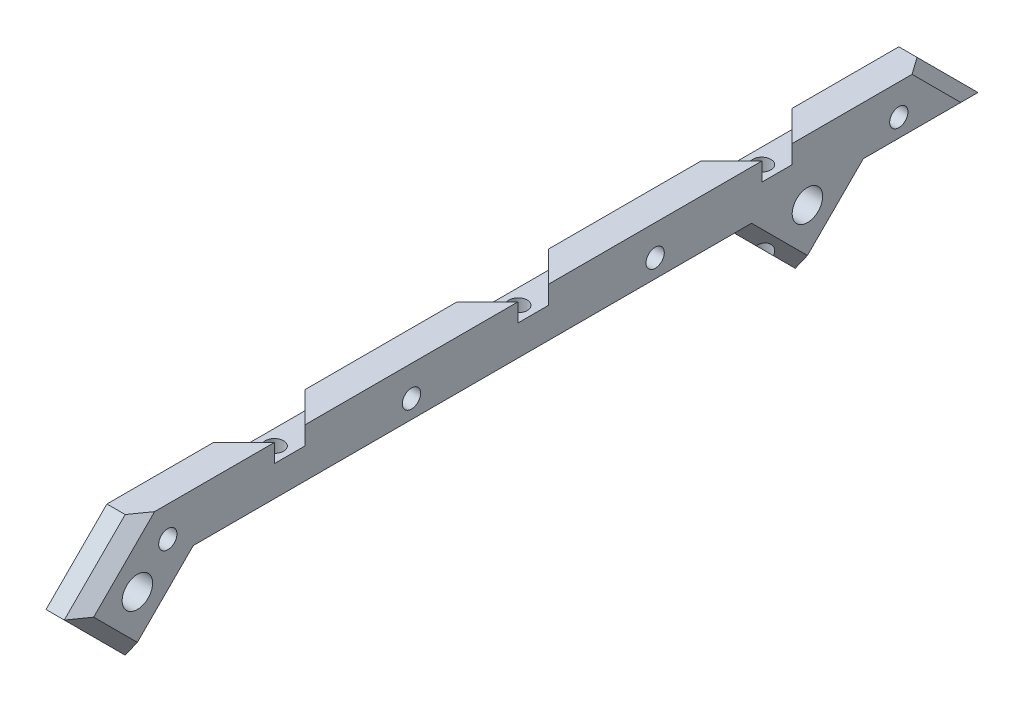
ISO-10303-21;
HEADER;
FILE_DESCRIPTION(('STEP AP214'),'2;1');
FILE_NAME('part.step','',(''),(''),'','','');
FILE_SCHEMA(('AUTOMOTIVE_DESIGN { 1 0 10303 214 1 1 1 1 }'));
ENDSEC;
DATA;
#1=APPLICATION_CONTEXT('core data for automotive mechanical design processes');
#2=APPLICATION_PROTOCOL_DEFINITION('international standard','automotive_design',2000,#1);
#3=PRODUCT_CONTEXT('',#1,'mechanical');
#4=PRODUCT('Part','Part','',(#3));
#5=PRODUCT_RELATED_PRODUCT_CATEGORY('part','',(#4));
#6=PRODUCT_DEFINITION_FORMATION('','',#4);
#7=PRODUCT_DEFINITION_CONTEXT('part definition',#1,'design');
#8=PRODUCT_DEFINITION('design','',#6,#7);
#9=PRODUCT_DEFINITION_SHAPE('','',#8);
#10=(LENGTH_UNIT() NAMED_UNIT(*) SI_UNIT(.MILLI.,.METRE.));
#11=(NAMED_UNIT(*) PLANE_ANGLE_UNIT() SI_UNIT($,.RADIAN.));
#12=(NAMED_UNIT(*) SI_UNIT($,.STERADIAN.) SOLID_ANGLE_UNIT());
#13=UNCERTAINTY_MEASURE_WITH_UNIT(LENGTH_MEASURE(1.E-05),#10,'distance_accuracy_value','');
#14=(GEOMETRIC_REPRESENTATION_CONTEXT(3) GLOBAL_UNCERTAINTY_ASSIGNED_CONTEXT((#13)) GLOBAL_UNIT_ASSIGNED_CONTEXT((#10,
#11,#12)) REPRESENTATION_CONTEXT('',''));
#15=CARTESIAN_POINT('',(0.,0.,0.));
#16=DIRECTION('',(0.,0.,1.));
#17=DIRECTION('',(1.,0.,0.));
#18=AXIS2_PLACEMENT_3D('',#15,#16,#17);
#19=CARTESIAN_POINT('',(5.,9.99999999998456,8.84041771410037E-13));
#20=DIRECTION('',(0.,1.,0.));
#21=DIRECTION('',(0.,0.,1.));
#22=AXIS2_PLACEMENT_3D('',#19,#20,#21);
#23=PLANE('',#22);
#24=DIRECTION('',(-0.707106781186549,0.,-0.707106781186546));
#25=VECTOR('',#24,1.);
#26=CARTESIAN_POINT('',(5.,9.99999999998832,-42.4999999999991));
#27=LINE('',#26,#25);
#28=CARTESIAN_POINT('',(5.,9.99999999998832,-42.4999999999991));
#29=VERTEX_POINT('',#28);
#30=CARTESIAN_POINT('',(0.,9.99999999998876,-47.4999999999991));
#31=VERTEX_POINT('',#30);
#32=EDGE_CURVE('E429',#29,#31,#27,.T.);
#33=ORIENTED_EDGE('',*,*,#32,.F.);
#34=DIRECTION('',(0.,0.,-1.));
#35=VECTOR('',#34,1.);
#36=CARTESIAN_POINT('',(5.,9.99999999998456,8.84041771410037E-13));
#37=LINE('',#36,#35);
#38=CARTESIAN_POINT('',(5.,9.99999999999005,-62.1715728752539));
#39=VERTEX_POINT('',#38);
#40=EDGE_CURVE('E428',#29,#39,#37,.T.);
#41=ORIENTED_EDGE('',*,*,#40,.T.);
#42=DIRECTION('',(-0.577350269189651,0.,-0.816496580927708));
#43=VECTOR('',#42,1.);
#44=CARTESIAN_POINT('',(34.3079605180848,9.99999999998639,-20.7238576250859));
#45=LINE('',#44,#43);
#46=CARTESIAN_POINT('',(2.99999999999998,9.9999999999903,-64.9999999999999));
#47=VERTEX_POINT('',#46);
#48=EDGE_CURVE('E371',#39,#47,#45,.T.);
#49=ORIENTED_EDGE('',*,*,#48,.T.);
#50=DIRECTION('',(-1.,0.,0.));
#51=VECTOR('',#50,1.);
#52=CARTESIAN_POINT('',(5.,9.9999999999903,-64.9999999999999));
#53=LINE('',#52,#51);
#54=CARTESIAN_POINT('',(0.,9.9999999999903,-64.9999999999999));
#55=VERTEX_POINT('',#54);
#56=EDGE_CURVE('E337',#47,#55,#53,.T.);
#57=ORIENTED_EDGE('',*,*,#56,.T.);
#58=DIRECTION('',(0.,0.,-1.));
#59=VECTOR('',#58,1.);
#60=CARTESIAN_POINT('',(0.,9.99999999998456,8.84041771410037E-13));
#61=LINE('',#60,#59);
#62=EDGE_CURVE('E324',#31,#55,#61,.T.);
#63=ORIENTED_EDGE('',*,*,#62,.F.);
#64=EDGE_LOOP('',(#33,#41,#49,#57,#63));
#65=FACE_BOUND('',#64,.T.);
#66=ADVANCED_FACE('F40',(#65),#23,.T.);
#67=DIRECTION('',(0.707106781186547,0.,-0.707106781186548));
#68=VECTOR('',#67,1.);
#69=CARTESIAN_POINT('',(23.75,9.99999999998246,23.7500000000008));
#70=LINE('',#69,#68);
#71=CARTESIAN_POINT('',(0.,9.99999999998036,47.5000000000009));
#72=VERTEX_POINT('',#71);
#73=CARTESIAN_POINT('',(5.,9.9999999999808,42.5000000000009));
#74=VERTEX_POINT('',#73);
#75=EDGE_CURVE('E986',#72,#74,#70,.T.);
#76=ORIENTED_EDGE('',*,*,#75,.F.);
#77=CARTESIAN_POINT('',(0.,9.99999999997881,64.9999999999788));
#78=VERTEX_POINT('',#77);
#79=EDGE_CURVE('E325',#78,#72,#61,.T.);
#80=ORIENTED_EDGE('',*,*,#79,.F.);
#81=DIRECTION('',(-1.,0.,0.));
#82=VECTOR('',#81,1.);
#83=CARTESIAN_POINT('',(5.,9.99999999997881,64.9999999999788));
#84=LINE('',#83,#82);
#85=CARTESIAN_POINT('',(2.99999999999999,9.99999999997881,64.9999999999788));
#86=VERTEX_POINT('',#85);
#87=EDGE_CURVE('E335',#86,#78,#84,.T.);
#88=ORIENTED_EDGE('',*,*,#87,.F.);
#89=DIRECTION('',(-0.577350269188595,0.,0.816496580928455));
#90=VECTOR('',#89,1.);
#91=CARTESIAN_POINT('',(34.3079605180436,9.99999999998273,20.7238576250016));
#92=LINE('',#91,#90);
#93=CARTESIAN_POINT('',(5.,9.99999999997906,62.171572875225));
#94=VERTEX_POINT('',#93);
#95=EDGE_CURVE('E369',#86,#94,#92,.F.);
#96=ORIENTED_EDGE('',*,*,#95,.T.);
#97=EDGE_CURVE('E301',#94,#74,#37,.T.);
#98=ORIENTED_EDGE('',*,*,#97,.T.);
#99=EDGE_LOOP('',(#76,#80,#88,#96,#98));
#100=FACE_BOUND('',#99,.T.);
#101=ADVANCED_FACE('F524',(#100),#23,.T.);
#102=DIRECTION('',(-0.707106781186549,0.,-0.707106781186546));
#103=VECTOR('',#102,1.);
#104=CARTESIAN_POINT('',(-16.25,9.99999999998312,16.2500000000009));
#105=LINE('',#104,#103);
#106=CARTESIAN_POINT('',(5.,9.99999999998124,37.5000000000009));
#107=VERTEX_POINT('',#106);
#108=CARTESIAN_POINT('',(0.,9.99999999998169,32.5000000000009));
#109=VERTEX_POINT('',#108);
#110=EDGE_CURVE('E448',#107,#109,#105,.T.);
#111=ORIENTED_EDGE('',*,*,#110,.F.);
#112=CARTESIAN_POINT('',(5.,9.99999999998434,2.50000000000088));
#113=VERTEX_POINT('',#112);
#114=EDGE_CURVE('E433',#107,#113,#37,.T.);
#115=ORIENTED_EDGE('',*,*,#114,.T.);
#116=DIRECTION('',(0.707106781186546,0.,-0.707106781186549));
#117=VECTOR('',#116,1.);
#118=CARTESIAN_POINT('',(3.75000000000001,9.99999999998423,3.75000000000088));
#119=LINE('',#118,#117);
#120=CARTESIAN_POINT('',(0.,9.9999999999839,7.5000000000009));
#121=VERTEX_POINT('',#120);
#122=EDGE_CURVE('E446',#121,#113,#119,.T.);
#123=ORIENTED_EDGE('',*,*,#122,.F.);
#124=EDGE_CURVE('E329',#109,#121,#61,.T.);
#125=ORIENTED_EDGE('',*,*,#124,.F.);
#126=EDGE_LOOP('',(#111,#115,#123,#125));
#127=FACE_BOUND('',#126,.T.);
#128=ADVANCED_FACE('F444',(#127),#23,.T.);
#129=CARTESIAN_POINT('',(5.,-37.5000000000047,37.4999999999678));
#130=DIRECTION('',(0.,0.707106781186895,-0.7071067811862));
#131=DIRECTION('',(0.,0.7071067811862,0.707106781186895));
#132=AXIS2_PLACEMENT_3D('',#129,#130,#131);
#133=PLANE('',#132);
#134=DIRECTION('',(-1.,0.,0.));
#135=VECTOR('',#134,1.);
#136=CARTESIAN_POINT('',(5.,-10.,64.9999999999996));
#137=LINE('',#136,#135);
#138=CARTESIAN_POINT('',(2.99999999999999,-10.,64.9999999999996));
#139=VERTEX_POINT('',#138);
#140=CARTESIAN_POINT('',(0.,-10.,64.9999999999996));
#141=VERTEX_POINT('',#140);
#142=EDGE_CURVE('E350',#139,#141,#137,.T.);
#143=ORIENTED_EDGE('',*,*,#142,.F.);
#144=DIRECTION('',(0.,0.7071067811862,0.707106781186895));
#145=VECTOR('',#144,1.);
#146=CARTESIAN_POINT('',(2.99999999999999,0.,75.0000000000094));
#147=LINE('',#146,#145);
#148=CARTESIAN_POINT('',(2.99999999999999,0.,75.0000000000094));
#149=VERTEX_POINT('',#148);
#150=EDGE_CURVE('E50',#139,#149,#147,.T.);
#151=ORIENTED_EDGE('',*,*,#150,.T.);
#152=DIRECTION('',(-1.,0.,0.));
#153=VECTOR('',#152,1.);
#154=CARTESIAN_POINT('',(5.,0.,75.0000000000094));
#155=LINE('',#154,#153);
#156=CARTESIAN_POINT('',(0.,0.,75.0000000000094));
#157=VERTEX_POINT('',#156);
#158=EDGE_CURVE('E333',#149,#157,#155,.T.);
#159=ORIENTED_EDGE('',*,*,#158,.T.);
#160=DIRECTION('',(0.,-0.7071067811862,-0.707106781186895));
#161=VECTOR('',#160,1.);
#162=CARTESIAN_POINT('',(0.,-37.5000000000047,37.4999999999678));
#163=LINE('',#162,#161);
#164=EDGE_CURVE('E298',#157,#141,#163,.T.);
#165=ORIENTED_EDGE('',*,*,#164,.T.);
#166=EDGE_LOOP('',(#143,#151,#159,#165));
#167=FACE_BOUND('',#166,.T.);
#168=ADVANCED_FACE('F537',(#167),#133,.F.);
#169=CARTESIAN_POINT('',(5.,27.4999999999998,27.5000000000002));
#170=DIRECTION('',(0.,0.707106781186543,0.707106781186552));
#171=DIRECTION('',(0.,-0.707106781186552,0.707106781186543));
#172=AXIS2_PLACEMENT_3D('',#169,#170,#171);
#173=PLANE('',#172);
#174=DIRECTION('',(-1.,0.,0.));
#175=VECTOR('',#174,1.);
#176=CARTESIAN_POINT('',(5.,0.,54.9999999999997));
#177=LINE('',#176,#175);
#178=CARTESIAN_POINT('',(2.99999999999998,0.,54.9999999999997));
#179=VERTEX_POINT('',#178);
#180=CARTESIAN_POINT('',(0.,0.,54.9999999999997));
#181=VERTEX_POINT('',#180);
#182=EDGE_CURVE('E348',#179,#181,#177,.T.);
#183=ORIENTED_EDGE('',*,*,#182,.F.);
#184=DIRECTION('',(0.,-0.707106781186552,0.707106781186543));
#185=VECTOR('',#184,1.);
#186=CARTESIAN_POINT('',(2.99999999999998,-10.,64.9999999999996));
#187=LINE('',#186,#185);
#188=EDGE_CURVE('E263',#179,#139,#187,.T.);
#189=ORIENTED_EDGE('',*,*,#188,.T.);
#190=ORIENTED_EDGE('',*,*,#142,.T.);
#191=DIRECTION('',(0.,0.707106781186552,-0.707106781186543));
#192=VECTOR('',#191,1.);
#193=CARTESIAN_POINT('',(0.,27.4999999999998,27.5000000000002));
#194=LINE('',#193,#192);
#195=EDGE_CURVE('E306',#141,#181,#194,.T.);
#196=ORIENTED_EDGE('',*,*,#195,.T.);
#197=EDGE_LOOP('',(#183,#189,#190,#196));
#198=FACE_BOUND('',#197,.T.);
#199=ADVANCED_FACE('F541',(#198),#173,.F.);
#200=CARTESIAN_POINT('',(5.,0.,0.));
#201=DIRECTION('',(0.,-1.,0.));
#202=DIRECTION('',(0.,0.,-1.));
#203=AXIS2_PLACEMENT_3D('',#200,#201,#202);
#204=PLANE('',#203);
#205=CARTESIAN_POINT('',(2.5,0.,40.));
#206=DIRECTION('',(0.,-1.,0.));
#207=DIRECTION('',(0.,0.,-1.));
#208=AXIS2_PLACEMENT_3D('',#205,#206,#207);
#209=CIRCLE('',#208,1.5);
#210=CARTESIAN_POINT('',(2.99999999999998,0.,41.4142135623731));
#211=VERTEX_POINT('',#210);
#212=CARTESIAN_POINT('',(2.99999999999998,0.,38.5857864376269));
#213=VERTEX_POINT('',#212);
#214=EDGE_CURVE('E57',#211,#213,#209,.T.);
#215=ORIENTED_EDGE('',*,*,#214,.F.);
#216=DIRECTION('',(0.,0.,1.));
#217=VECTOR('',#216,1.);
#218=CARTESIAN_POINT('',(2.99999999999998,0.,0.));
#219=LINE('',#218,#217);
#220=EDGE_CURVE('E255',#211,#179,#219,.T.);
#221=ORIENTED_EDGE('',*,*,#220,.T.);
#222=ORIENTED_EDGE('',*,*,#182,.T.);
#223=DIRECTION('',(0.,0.,1.));
#224=VECTOR('',#223,1.);
#225=CARTESIAN_POINT('',(0.,0.,0.));
#226=LINE('',#225,#224);
#227=CARTESIAN_POINT('',(0.,0.,-35.0000000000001));
#228=VERTEX_POINT('',#227);
#229=EDGE_CURVE('E309',#228,#181,#226,.T.);
#230=ORIENTED_EDGE('',*,*,#229,.F.);
#231=DIRECTION('',(-1.,0.,0.));
#232=VECTOR('',#231,1.);
#233=CARTESIAN_POINT('',(5.,0.,-35.0000000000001));
#234=LINE('',#233,#232);
#235=CARTESIAN_POINT('',(2.99999999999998,0.,-35.0000000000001));
#236=VERTEX_POINT('',#235);
#237=EDGE_CURVE('E346',#236,#228,#234,.T.);
#238=ORIENTED_EDGE('',*,*,#237,.F.);
#239=CARTESIAN_POINT('',(2.99999999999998,0.,-1.4142135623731));
#240=VERTEX_POINT('',#239);
#241=EDGE_CURVE('E260',#236,#240,#219,.T.);
#242=ORIENTED_EDGE('',*,*,#241,.T.);
#243=CARTESIAN_POINT('',(2.5,0.,0.));
#244=DIRECTION('',(0.,-1.,0.));
#245=DIRECTION('',(0.,0.,-1.));
#246=AXIS2_PLACEMENT_3D('',#243,#244,#245);
#247=CIRCLE('',#246,1.5);
#248=CARTESIAN_POINT('',(2.99999999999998,0.,1.4142135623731));
#249=VERTEX_POINT('',#248);
#250=EDGE_CURVE('E64',#249,#240,#247,.T.);
#251=ORIENTED_EDGE('',*,*,#250,.F.);
#252=EDGE_CURVE('E264',#249,#213,#219,.T.);
#253=ORIENTED_EDGE('',*,*,#252,.T.);
#254=EDGE_LOOP('',(#215,#221,#222,#230,#238,#242,#251,#253));
#255=FACE_BOUND('',#254,.T.);
#256=ADVANCED_FACE('F407',(#255),#204,.T.);
#257=CARTESIAN_POINT('',(5.,17.5000000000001,-17.5000000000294));
#258=DIRECTION('',(0.,-0.707106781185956,0.707106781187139));
#259=DIRECTION('',(0.,-0.707106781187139,-0.707106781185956));
#260=AXIS2_PLACEMENT_3D('',#257,#258,#259);
#261=PLANE('',#260);
#262=CARTESIAN_POINT('',(2.5,-5.00000000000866,-40.0000000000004));
#263=DIRECTION('',(0.,-0.707106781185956,0.707106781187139));
#264=DIRECTION('',(0.,0.707106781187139,0.707106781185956));
#265=AXIS2_PLACEMENT_3D('',#262,#263,#264);
#266=ELLIPSE('',#265,2.12132034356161,1.5);
#267=CARTESIAN_POINT('',(2.99999999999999,-3.58578643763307,-38.5857864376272));
#268=VERTEX_POINT('',#267);
#269=CARTESIAN_POINT('',(2.99999999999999,-6.41421356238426,-41.4142135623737));
#270=VERTEX_POINT('',#269);
#271=EDGE_CURVE('E233',#268,#270,#266,.T.);
#272=ORIENTED_EDGE('',*,*,#271,.F.);
#273=DIRECTION('',(0.,0.707106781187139,0.707106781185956));
#274=VECTOR('',#273,1.);
#275=CARTESIAN_POINT('',(2.99999999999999,17.5000000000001,-17.5000000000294));
#276=LINE('',#275,#274);
#277=EDGE_CURVE('E242',#268,#236,#276,.T.);
#278=ORIENTED_EDGE('',*,*,#277,.T.);
#279=ORIENTED_EDGE('',*,*,#237,.T.);
#280=DIRECTION('',(0.,0.707106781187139,0.707106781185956));
#281=VECTOR('',#280,1.);
#282=CARTESIAN_POINT('',(0.,17.5000000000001,-17.5000000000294));
#283=LINE('',#282,#281);
#284=CARTESIAN_POINT('',(0.,-10.,-44.9999999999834));
#285=VERTEX_POINT('',#284);
#286=EDGE_CURVE('E312',#285,#228,#283,.T.);
#287=ORIENTED_EDGE('',*,*,#286,.F.);
#288=DIRECTION('',(-1.,0.,0.));
#289=VECTOR('',#288,1.);
#290=CARTESIAN_POINT('',(5.,-10.,-44.9999999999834));
#291=LINE('',#290,#289);
#292=CARTESIAN_POINT('',(2.99999999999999,-10.,-44.9999999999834));
#293=VERTEX_POINT('',#292);
#294=EDGE_CURVE('E344',#293,#285,#291,.T.);
#295=ORIENTED_EDGE('',*,*,#294,.F.);
#296=EDGE_CURVE('E245',#293,#270,#276,.T.);
#297=ORIENTED_EDGE('',*,*,#296,.T.);
#298=EDGE_LOOP('',(#272,#278,#279,#287,#295,#297));
#299=FACE_BOUND('',#298,.T.);
#300=ADVANCED_FACE('F241',(#299),#261,.T.);
#301=CARTESIAN_POINT('',(5.,-27.5000000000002,-27.4999999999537));
#302=DIRECTION('',(0.,0.707106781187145,0.70710678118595));
#303=DIRECTION('',(0.,-0.70710678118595,0.707106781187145));
#304=AXIS2_PLACEMENT_3D('',#301,#302,#303);
#305=PLANE('',#304);
#306=DIRECTION('',(-1.,0.,0.));
#307=VECTOR('',#306,1.);
#308=CARTESIAN_POINT('',(5.,0.,-55.0000000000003));
#309=LINE('',#308,#307);
#310=CARTESIAN_POINT('',(2.99999999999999,0.,-55.0000000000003));
#311=VERTEX_POINT('',#310);
#312=CARTESIAN_POINT('',(0.,0.,-55.0000000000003));
#313=VERTEX_POINT('',#312);
#314=EDGE_CURVE('E342',#311,#313,#309,.T.);
#315=ORIENTED_EDGE('',*,*,#314,.F.);
#316=DIRECTION('',(0.,-0.70710678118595,0.707106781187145));
#317=VECTOR('',#316,1.);
#318=CARTESIAN_POINT('',(2.99999999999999,-10.,-44.9999999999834));
#319=LINE('',#318,#317);
#320=EDGE_CURVE('E253',#311,#293,#319,.T.);
#321=ORIENTED_EDGE('',*,*,#320,.T.);
#322=ORIENTED_EDGE('',*,*,#294,.T.);
#323=DIRECTION('',(0.,0.70710678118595,-0.707106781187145));
#324=VECTOR('',#323,1.);
#325=CARTESIAN_POINT('',(0.,-27.5000000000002,-27.4999999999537));
#326=LINE('',#325,#324);
#327=EDGE_CURVE('E315',#285,#313,#326,.T.);
#328=ORIENTED_EDGE('',*,*,#327,.T.);
#329=EDGE_LOOP('',(#315,#321,#322,#328));
#330=FACE_BOUND('',#329,.T.);
#331=ADVANCED_FACE('F383',(#330),#305,.F.);
#332=CARTESIAN_POINT('',(5.,0.,0.));
#333=DIRECTION('',(0.,1.,0.));
#334=DIRECTION('',(0.,0.,1.));
#335=AXIS2_PLACEMENT_3D('',#332,#333,#334);
#336=PLANE('',#335);
#337=DIRECTION('',(-1.,0.,0.));
#338=VECTOR('',#337,1.);
#339=CARTESIAN_POINT('',(5.,0.,-74.9999999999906));
#340=LINE('',#339,#338);
#341=CARTESIAN_POINT('',(2.99999999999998,0.,-74.9999999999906));
#342=VERTEX_POINT('',#341);
#343=CARTESIAN_POINT('',(0.,0.,-74.9999999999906));
#344=VERTEX_POINT('',#343);
#345=EDGE_CURVE('E340',#342,#344,#340,.T.);
#346=ORIENTED_EDGE('',*,*,#345,.F.);
#347=DIRECTION('',(0.,0.,1.));
#348=VECTOR('',#347,1.);
#349=CARTESIAN_POINT('',(2.99999999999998,0.,-55.0000000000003));
#350=LINE('',#349,#348);
#351=EDGE_CURVE('E256',#342,#311,#350,.T.);
#352=ORIENTED_EDGE('',*,*,#351,.T.);
#353=ORIENTED_EDGE('',*,*,#314,.T.);
#354=DIRECTION('',(0.,0.,-1.));
#355=VECTOR('',#354,1.);
#356=CARTESIAN_POINT('',(0.,0.,0.));
#357=LINE('',#356,#355);
#358=EDGE_CURVE('E318',#313,#344,#357,.T.);
#359=ORIENTED_EDGE('',*,*,#358,.T.);
#360=EDGE_LOOP('',(#346,#352,#353,#359));
#361=FACE_BOUND('',#360,.T.);
#362=ADVANCED_FACE('F378',(#361),#336,.F.);
#363=CARTESIAN_POINT('',(5.,37.4999999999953,-37.4999999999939));
#364=DIRECTION('',(0.,-0.707106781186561,0.707106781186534));
#365=DIRECTION('',(0.,-0.707106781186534,-0.707106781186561));
#366=AXIS2_PLACEMENT_3D('',#363,#364,#365);
#367=PLANE('',#366);
#368=ORIENTED_EDGE('',*,*,#56,.F.);
#369=DIRECTION('',(0.,-0.707106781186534,-0.707106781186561));
#370=VECTOR('',#369,1.);
#371=CARTESIAN_POINT('',(2.99999999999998,0.,-74.9999999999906));
#372=LINE('',#371,#370);
#373=EDGE_CURVE('E373',#47,#342,#372,.T.);
#374=ORIENTED_EDGE('',*,*,#373,.T.);
#375=ORIENTED_EDGE('',*,*,#345,.T.);
#376=DIRECTION('',(0.,0.707106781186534,0.707106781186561));
#377=VECTOR('',#376,1.);
#378=CARTESIAN_POINT('',(0.,37.4999999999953,-37.4999999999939));
#379=LINE('',#378,#377);
#380=EDGE_CURVE('E321',#344,#55,#379,.T.);
#381=ORIENTED_EDGE('',*,*,#380,.T.);
#382=EDGE_LOOP('',(#368,#374,#375,#381));
#383=FACE_BOUND('',#382,.T.);
#384=ADVANCED_FACE('F421',(#383),#367,.F.);
#385=DIRECTION('',(0.707106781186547,0.,-0.707106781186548));
#386=VECTOR('',#385,1.);
#387=CARTESIAN_POINT('',(0.,9.99999999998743,-32.4999999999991));
#388=LINE('',#387,#386);
#389=CARTESIAN_POINT('',(0.,9.99999999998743,-32.4999999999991));
#390=VERTEX_POINT('',#389);
#391=CARTESIAN_POINT('',(5.,9.99999999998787,-37.4999999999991));
#392=VERTEX_POINT('',#391);
#393=EDGE_CURVE('E979',#390,#392,#388,.T.);
#394=ORIENTED_EDGE('',*,*,#393,.F.);
#395=CARTESIAN_POINT('',(0.,9.99999999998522,-7.49999999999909));
#396=VERTEX_POINT('',#395);
#397=EDGE_CURVE('E1029',#396,#390,#61,.T.);
#398=ORIENTED_EDGE('',*,*,#397,.F.);
#399=DIRECTION('',(-0.707106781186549,0.,-0.707106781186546));
#400=VECTOR('',#399,1.);
#401=CARTESIAN_POINT('',(3.74999999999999,9.99999999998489,-3.74999999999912));
#402=LINE('',#401,#400);
#403=CARTESIAN_POINT('',(5.,9.99999999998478,-2.49999999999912));
#404=VERTEX_POINT('',#403);
#405=EDGE_CURVE('E989',#404,#396,#402,.T.);
#406=ORIENTED_EDGE('',*,*,#405,.F.);
#407=EDGE_CURVE('E430',#404,#392,#37,.T.);
#408=ORIENTED_EDGE('',*,*,#407,.T.);
#409=EDGE_LOOP('',(#394,#398,#406,#408));
#410=FACE_BOUND('',#409,.T.);
#411=ADVANCED_FACE('F511',(#410),#23,.T.);
#412=CARTESIAN_POINT('',(5.,0.,64.9999999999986));
#413=DIRECTION('',(-1.,0.,0.));
#414=DIRECTION('',(0.,0.,1.));
#415=AXIS2_PLACEMENT_3D('',#412,#413,#414);
#416=CYLINDRICAL_SURFACE('',#415,2.50000000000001);
#417=CARTESIAN_POINT('',(5.,0.,64.9999999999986));
#418=DIRECTION('',(1.,0.,0.));
#419=DIRECTION('',(0.,0.,-1.));
#420=AXIS2_PLACEMENT_3D('',#417,#418,#419);
#421=CIRCLE('',#420,2.50000000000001);
#422=CARTESIAN_POINT('',(5.,0.,62.4999999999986));
#423=VERTEX_POINT('',#422);
#424=EDGE_CURVE('E431',#423,#423,#421,.T.);
#425=ORIENTED_EDGE('',*,*,#424,.T.);
#426=EDGE_LOOP('',(#425));
#427=FACE_BOUND('',#426,.T.);
#428=CARTESIAN_POINT('',(0.,0.,64.9999999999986));
#429=DIRECTION('',(1.,0.,0.));
#430=DIRECTION('',(0.,0.,-1.));
#431=AXIS2_PLACEMENT_3D('',#428,#429,#430);
#432=CIRCLE('',#431,2.50000000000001);
#433=CARTESIAN_POINT('',(0.,0.,62.4999999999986));
#434=VERTEX_POINT('',#433);
#435=EDGE_CURVE('E293',#434,#434,#432,.T.);
#436=ORIENTED_EDGE('',*,*,#435,.F.);
#437=EDGE_LOOP('',(#436));
#438=FACE_BOUND('',#437,.T.);
#439=ADVANCED_FACE('F508',(#427,#438),#416,.F.);
#440=CARTESIAN_POINT('',(5.,0.,-44.9999999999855));
#441=DIRECTION('',(-1.,0.,0.));
#442=DIRECTION('',(0.,0.,1.));
#443=AXIS2_PLACEMENT_3D('',#440,#441,#442);
#444=CYLINDRICAL_SURFACE('',#443,2.5);
#445=CARTESIAN_POINT('',(5.,0.,-44.9999999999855));
#446=DIRECTION('',(1.,0.,0.));
#447=DIRECTION('',(0.,0.,-1.));
#448=AXIS2_PLACEMENT_3D('',#445,#446,#447);
#449=CIRCLE('',#448,2.5);
#450=CARTESIAN_POINT('',(5.,0.,-47.4999999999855));
#451=VERTEX_POINT('',#450);
#452=EDGE_CURVE('E332',#451,#451,#449,.T.);
#453=ORIENTED_EDGE('',*,*,#452,.T.);
#454=EDGE_LOOP('',(#453));
#455=FACE_BOUND('',#454,.T.);
#456=CARTESIAN_POINT('',(0.,0.,-44.9999999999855));
#457=DIRECTION('',(1.,0.,0.));
#458=DIRECTION('',(0.,0.,-1.));
#459=AXIS2_PLACEMENT_3D('',#456,#457,#458);
#460=CIRCLE('',#459,2.5);
#461=CARTESIAN_POINT('',(0.,0.,-47.4999999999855));
#462=VERTEX_POINT('',#461);
#463=EDGE_CURVE('E287',#462,#462,#460,.T.);
#464=ORIENTED_EDGE('',*,*,#463,.F.);
#465=EDGE_LOOP('',(#464));
#466=FACE_BOUND('',#465,.T.);
#467=ADVANCED_FACE('F499',(#455,#466),#444,.F.);
#468=CARTESIAN_POINT('',(5.,37.5000000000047,37.4999999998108));
#469=DIRECTION('',(0.,0.707106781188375,0.70710678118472));
#470=DIRECTION('',(0.,-0.70710678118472,0.707106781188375));
#471=AXIS2_PLACEMENT_3D('',#468,#469,#470);
#472=PLANE('',#471);
#473=ORIENTED_EDGE('',*,*,#158,.F.);
#474=DIRECTION('',(0.,0.70710678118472,-0.707106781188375));
#475=VECTOR('',#474,1.);
#476=CARTESIAN_POINT('',(2.99999999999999,37.5000000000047,37.4999999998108));
#477=LINE('',#476,#475);
#478=EDGE_CURVE('E11',#149,#86,#477,.T.);
#479=ORIENTED_EDGE('',*,*,#478,.T.);
#480=ORIENTED_EDGE('',*,*,#87,.T.);
#481=DIRECTION('',(0.,0.70710678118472,-0.707106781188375));
#482=VECTOR('',#481,1.);
#483=CARTESIAN_POINT('',(0.,37.5000000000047,37.4999999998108));
#484=LINE('',#483,#482);
#485=EDGE_CURVE('E328',#157,#78,#484,.T.);
#486=ORIENTED_EDGE('',*,*,#485,.F.);
#487=EDGE_LOOP('',(#473,#479,#480,#486));
#488=FACE_BOUND('',#487,.T.);
#489=ADVANCED_FACE('F504',(#488),#472,.T.);
#490=CARTESIAN_POINT('',(5.,0.,0.));
#491=DIRECTION('',(1.,0.,0.));
#492=DIRECTION('',(0.,0.,-1.));
#493=AXIS2_PLACEMENT_3D('',#490,#491,#492);
#494=PLANE('',#493);
#495=DIRECTION('',(0.,1.,0.));
#496=VECTOR('',#495,1.);
#497=CARTESIAN_POINT('',(5.,6.99999999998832,-42.4999999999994));
#498=LINE('',#497,#496);
#499=CARTESIAN_POINT('',(5.,6.99999999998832,-42.4999999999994));
#500=VERTEX_POINT('',#499);
#501=EDGE_CURVE('E1003',#500,#29,#498,.T.);
#502=ORIENTED_EDGE('',*,*,#501,.F.);
#503=DIRECTION('',(0.,0.,-1.));
#504=VECTOR('',#503,1.);
#505=CARTESIAN_POINT('',(5.,6.99999999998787,-37.4999999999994));
#506=LINE('',#505,#504);
#507=CARTESIAN_POINT('',(5.,6.99999999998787,-37.4999999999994));
#508=VERTEX_POINT('',#507);
#509=EDGE_CURVE('E1010',#508,#500,#506,.T.);
#510=ORIENTED_EDGE('',*,*,#509,.F.);
#511=DIRECTION('',(0.,1.,0.));
#512=VECTOR('',#511,1.);
#513=CARTESIAN_POINT('',(5.,6.99999999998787,-37.4999999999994));
#514=LINE('',#513,#512);
#515=EDGE_CURVE('E1000',#508,#392,#514,.T.);
#516=ORIENTED_EDGE('',*,*,#515,.T.);
#517=ORIENTED_EDGE('',*,*,#407,.F.);
#518=DIRECTION('',(0.,1.,0.));
#519=VECTOR('',#518,1.);
#520=CARTESIAN_POINT('',(5.,6.99999999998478,-2.49999999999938));
#521=LINE('',#520,#519);
#522=CARTESIAN_POINT('',(5.,6.99999999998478,-2.49999999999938));
#523=VERTEX_POINT('',#522);
#524=EDGE_CURVE('E474',#523,#404,#521,.T.);
#525=ORIENTED_EDGE('',*,*,#524,.F.);
#526=DIRECTION('',(0.,0.,-1.));
#527=VECTOR('',#526,1.);
#528=CARTESIAN_POINT('',(5.,6.99999999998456,6.18819357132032E-13));
#529=LINE('',#528,#527);
#530=CARTESIAN_POINT('',(5.,6.99999999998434,2.50000000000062));
#531=VERTEX_POINT('',#530);
#532=EDGE_CURVE('E457',#531,#523,#529,.T.);
#533=ORIENTED_EDGE('',*,*,#532,.F.);
#534=DIRECTION('',(0.,1.,0.));
#535=VECTOR('',#534,1.);
#536=CARTESIAN_POINT('',(5.,6.99999999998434,2.50000000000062));
#537=LINE('',#536,#535);
#538=EDGE_CURVE('E454',#531,#113,#537,.T.);
#539=ORIENTED_EDGE('',*,*,#538,.T.);
#540=ORIENTED_EDGE('',*,*,#114,.F.);
#541=DIRECTION('',(0.,1.,0.));
#542=VECTOR('',#541,1.);
#543=CARTESIAN_POINT('',(5.,6.99999999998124,37.5000000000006));
#544=LINE('',#543,#542);
#545=CARTESIAN_POINT('',(5.,6.99999999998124,37.5000000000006));
#546=VERTEX_POINT('',#545);
#547=EDGE_CURVE('E452',#546,#107,#544,.T.);
#548=ORIENTED_EDGE('',*,*,#547,.F.);
#549=DIRECTION('',(0.,0.,-1.));
#550=VECTOR('',#549,1.);
#551=CARTESIAN_POINT('',(5.,6.99999999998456,6.18819357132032E-13));
#552=LINE('',#551,#550);
#553=CARTESIAN_POINT('',(5.,6.9999999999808,42.5000000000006));
#554=VERTEX_POINT('',#553);
#555=EDGE_CURVE('E975',#554,#546,#552,.T.);
#556=ORIENTED_EDGE('',*,*,#555,.F.);
#557=DIRECTION('',(0.,1.,0.));
#558=VECTOR('',#557,1.);
#559=CARTESIAN_POINT('',(5.,6.9999999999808,42.5000000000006));
#560=LINE('',#559,#558);
#561=EDGE_CURVE('E973',#554,#74,#560,.T.);
#562=ORIENTED_EDGE('',*,*,#561,.T.);
#563=ORIENTED_EDGE('',*,*,#97,.F.);
#564=DIRECTION('',(0.,-0.70710678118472,0.707106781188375));
#565=VECTOR('',#564,1.);
#566=CARTESIAN_POINT('',(5.,36.0857864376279,36.0857864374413));
#567=LINE('',#566,#565);
#568=CARTESIAN_POINT('',(5.,-3.01824719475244E-12,72.1715728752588));
#569=VERTEX_POINT('',#568);
#570=EDGE_CURVE('E352',#94,#569,#567,.T.);
#571=ORIENTED_EDGE('',*,*,#570,.T.);
#572=DIRECTION('',(0.,-0.7071067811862,-0.707106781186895));
#573=VECTOR('',#572,1.);
#574=CARTESIAN_POINT('',(5.,-8.5857864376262,63.5857864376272));
#575=LINE('',#574,#573);
#576=CARTESIAN_POINT('',(5.,-7.17157287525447,65.0000000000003));
#577=VERTEX_POINT('',#576);
#578=EDGE_CURVE('E354',#569,#577,#575,.T.);
#579=ORIENTED_EDGE('',*,*,#578,.T.);
#580=DIRECTION('',(0.,0.707106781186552,-0.707106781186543));
#581=VECTOR('',#580,1.);
#582=CARTESIAN_POINT('',(5.,1.41421356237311,56.4142135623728));
#583=LINE('',#582,#581);
#584=CARTESIAN_POINT('',(5.,2.00000000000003,55.8284271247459));
#585=VERTEX_POINT('',#584);
#586=EDGE_CURVE('E356',#577,#585,#583,.T.);
#587=ORIENTED_EDGE('',*,*,#586,.T.);
#588=DIRECTION('',(0.,0.,-1.));
#589=VECTOR('',#588,1.);
#590=CARTESIAN_POINT('',(5.,2.00000000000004,0.));
#591=LINE('',#590,#589);
#592=CARTESIAN_POINT('',(5.,2.00000000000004,-35.8284271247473));
#593=VERTEX_POINT('',#592);
#594=EDGE_CURVE('E358',#585,#593,#591,.T.);
#595=ORIENTED_EDGE('',*,*,#594,.T.);
#596=DIRECTION('',(0.,-0.707106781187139,-0.707106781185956));
#597=VECTOR('',#596,1.);
#598=CARTESIAN_POINT('',(5.,18.914213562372,-18.9142135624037));
#599=LINE('',#598,#597);
#600=CARTESIAN_POINT('',(5.,-7.17157287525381,-44.9999999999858));
#601=VERTEX_POINT('',#600);
#602=EDGE_CURVE('E360',#593,#601,#599,.T.);
#603=ORIENTED_EDGE('',*,*,#602,.T.);
#604=DIRECTION('',(0.,0.70710678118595,-0.707106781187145));
#605=VECTOR('',#604,1.);
#606=CARTESIAN_POINT('',(5.,1.4142135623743,-53.5857864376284));
#607=LINE('',#606,#605);
#608=CARTESIAN_POINT('',(5.,2.00000000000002,-54.1715728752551));
#609=VERTEX_POINT('',#608);
#610=EDGE_CURVE('E362',#601,#609,#607,.T.);
#611=ORIENTED_EDGE('',*,*,#610,.T.);
#612=DIRECTION('',(0.,0.,-1.));
#613=VECTOR('',#612,1.);
#614=CARTESIAN_POINT('',(5.,2.,-74.9999999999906));
#615=LINE('',#614,#613);
#616=CARTESIAN_POINT('',(5.,2.00000000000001,-70.1715728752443));
#617=VERTEX_POINT('',#616);
#618=EDGE_CURVE('E364',#609,#617,#615,.T.);
#619=ORIENTED_EDGE('',*,*,#618,.T.);
#620=DIRECTION('',(0.,0.707106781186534,0.707106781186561));
#621=VECTOR('',#620,1.);
#622=CARTESIAN_POINT('',(5.,8.58578643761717,-63.5857864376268));
#623=LINE('',#622,#621);
#624=EDGE_CURVE('E366',#617,#39,#623,.T.);
#625=ORIENTED_EDGE('',*,*,#624,.T.);
#626=ORIENTED_EDGE('',*,*,#40,.F.);
#627=EDGE_LOOP('',(#502,#510,#516,#517,#525,#533,#539,#540,#548,#556,#562,#563,#571,#579,#587,
#595,#603,#611,#619,#625,#626));
#628=FACE_BOUND('',#627,.T.);
#629=CARTESIAN_POINT('',(5.,4.99999999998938,60.0000000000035));
#630=DIRECTION('',(1.,0.,0.));
#631=DIRECTION('',(0.,0.,-1.));
#632=AXIS2_PLACEMENT_3D('',#629,#630,#631);
#633=CIRCLE('',#632,1.5);
#634=CARTESIAN_POINT('',(5.,4.99999999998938,58.5000000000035));
#635=VERTEX_POINT('',#634);
#636=EDGE_CURVE('E479',#635,#635,#633,.T.);
#637=ORIENTED_EDGE('',*,*,#636,.F.);
#638=EDGE_LOOP('',(#637));
#639=FACE_BOUND('',#638,.T.);
#640=CARTESIAN_POINT('',(5.,4.99999999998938,20.0000000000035));
#641=DIRECTION('',(1.,0.,0.));
#642=DIRECTION('',(0.,0.,-1.));
#643=AXIS2_PLACEMENT_3D('',#640,#641,#642);
#644=CIRCLE('',#643,1.5);
#645=CARTESIAN_POINT('',(5.,4.99999999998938,18.5000000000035));
#646=VERTEX_POINT('',#645);
#647=EDGE_CURVE('E482',#646,#646,#644,.T.);
#648=ORIENTED_EDGE('',*,*,#647,.F.);
#649=EDGE_LOOP('',(#648));
#650=FACE_BOUND('',#649,.T.);
#651=CARTESIAN_POINT('',(5.,4.99999999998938,-19.9999999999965));
#652=DIRECTION('',(1.,0.,0.));
#653=DIRECTION('',(0.,0.,-1.));
#654=AXIS2_PLACEMENT_3D('',#651,#652,#653);
#655=CIRCLE('',#654,1.5);
#656=CARTESIAN_POINT('',(5.,4.99999999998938,-21.4999999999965));
#657=VERTEX_POINT('',#656);
#658=EDGE_CURVE('E488',#657,#657,#655,.T.);
#659=ORIENTED_EDGE('',*,*,#658,.F.);
#660=EDGE_LOOP('',(#659));
#661=FACE_BOUND('',#660,.T.);
#662=CARTESIAN_POINT('',(5.,4.99999999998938,-59.9999999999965));
#663=DIRECTION('',(1.,0.,0.));
#664=DIRECTION('',(0.,0.,-1.));
#665=AXIS2_PLACEMENT_3D('',#662,#663,#664);
#666=CIRCLE('',#665,1.5);
#667=CARTESIAN_POINT('',(5.,4.99999999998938,-61.4999999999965));
#668=VERTEX_POINT('',#667);
#669=EDGE_CURVE('E465',#668,#668,#666,.T.);
#670=ORIENTED_EDGE('',*,*,#669,.F.);
#671=EDGE_LOOP('',(#670));
#672=FACE_BOUND('',#671,.T.);
#673=ORIENTED_EDGE('',*,*,#452,.F.);
#674=EDGE_LOOP('',(#673));
#675=FACE_BOUND('',#674,.T.);
#676=ORIENTED_EDGE('',*,*,#424,.F.);
#677=EDGE_LOOP('',(#676));
#678=FACE_BOUND('',#677,.T.);
#679=ADVANCED_FACE('F396',(#628,#639,#650,#661,#672,#675,#678),#494,.T.);
#680=CARTESIAN_POINT('',(0.,0.,0.));
#681=DIRECTION('',(1.,0.,0.));
#682=DIRECTION('',(0.,0.,-1.));
#683=AXIS2_PLACEMENT_3D('',#680,#681,#682);
#684=PLANE('',#683);
#685=DIRECTION('',(0.,0.,1.));
#686=VECTOR('',#685,1.);
#687=CARTESIAN_POINT('',(0.,6.99999999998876,-47.4999999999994));
#688=LINE('',#687,#686);
#689=CARTESIAN_POINT('',(0.,6.99999999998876,-47.4999999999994));
#690=VERTEX_POINT('',#689);
#691=CARTESIAN_POINT('',(0.,6.99999999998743,-32.4999999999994));
#692=VERTEX_POINT('',#691);
#693=EDGE_CURVE('E1007',#690,#692,#688,.T.);
#694=ORIENTED_EDGE('',*,*,#693,.F.);
#695=DIRECTION('',(0.,1.,0.));
#696=VECTOR('',#695,1.);
#697=CARTESIAN_POINT('',(0.,6.99999999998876,-47.4999999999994));
#698=LINE('',#697,#696);
#699=EDGE_CURVE('E1005',#690,#31,#698,.T.);
#700=ORIENTED_EDGE('',*,*,#699,.T.);
#701=ORIENTED_EDGE('',*,*,#62,.T.);
#702=ORIENTED_EDGE('',*,*,#380,.F.);
#703=ORIENTED_EDGE('',*,*,#358,.F.);
#704=ORIENTED_EDGE('',*,*,#327,.F.);
#705=ORIENTED_EDGE('',*,*,#286,.T.);
#706=ORIENTED_EDGE('',*,*,#229,.T.);
#707=ORIENTED_EDGE('',*,*,#195,.F.);
#708=ORIENTED_EDGE('',*,*,#164,.F.);
#709=ORIENTED_EDGE('',*,*,#485,.T.);
#710=ORIENTED_EDGE('',*,*,#79,.T.);
#711=DIRECTION('',(0.,1.,0.));
#712=VECTOR('',#711,1.);
#713=CARTESIAN_POINT('',(0.,6.99999999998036,47.5000000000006));
#714=LINE('',#713,#712);
#715=CARTESIAN_POINT('',(0.,6.99999999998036,47.5000000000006));
#716=VERTEX_POINT('',#715);
#717=EDGE_CURVE('E978',#716,#72,#714,.T.);
#718=ORIENTED_EDGE('',*,*,#717,.F.);
#719=DIRECTION('',(0.,0.,1.));
#720=VECTOR('',#719,1.);
#721=CARTESIAN_POINT('',(0.,6.99999999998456,6.18819357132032E-13));
#722=LINE('',#721,#720);
#723=CARTESIAN_POINT('',(0.,6.99999999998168,32.5000000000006));
#724=VERTEX_POINT('',#723);
#725=EDGE_CURVE('E992',#724,#716,#722,.T.);
#726=ORIENTED_EDGE('',*,*,#725,.F.);
#727=DIRECTION('',(0.,1.,0.));
#728=VECTOR('',#727,1.);
#729=CARTESIAN_POINT('',(0.,6.99999999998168,32.5000000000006));
#730=LINE('',#729,#728);
#731=EDGE_CURVE('E981',#724,#109,#730,.T.);
#732=ORIENTED_EDGE('',*,*,#731,.T.);
#733=ORIENTED_EDGE('',*,*,#124,.T.);
#734=DIRECTION('',(0.,1.,0.));
#735=VECTOR('',#734,1.);
#736=CARTESIAN_POINT('',(0.,6.99999999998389,7.50000000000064));
#737=LINE('',#736,#735);
#738=CARTESIAN_POINT('',(0.,6.99999999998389,7.50000000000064));
#739=VERTEX_POINT('',#738);
#740=EDGE_CURVE('E462',#739,#121,#737,.T.);
#741=ORIENTED_EDGE('',*,*,#740,.F.);
#742=DIRECTION('',(0.,0.,1.));
#743=VECTOR('',#742,1.);
#744=CARTESIAN_POINT('',(0.,6.99999999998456,6.18819357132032E-13));
#745=LINE('',#744,#743);
#746=CARTESIAN_POINT('',(0.,6.99999999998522,-7.49999999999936));
#747=VERTEX_POINT('',#746);
#748=EDGE_CURVE('E1020',#747,#739,#745,.T.);
#749=ORIENTED_EDGE('',*,*,#748,.F.);
#750=DIRECTION('',(0.,1.,0.));
#751=VECTOR('',#750,1.);
#752=CARTESIAN_POINT('',(0.,6.99999999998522,-7.49999999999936));
#753=LINE('',#752,#751);
#754=EDGE_CURVE('E467',#747,#396,#753,.T.);
#755=ORIENTED_EDGE('',*,*,#754,.T.);
#756=ORIENTED_EDGE('',*,*,#397,.T.);
#757=DIRECTION('',(0.,1.,0.));
#758=VECTOR('',#757,1.);
#759=CARTESIAN_POINT('',(0.,6.99999999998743,-32.4999999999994));
#760=LINE('',#759,#758);
#761=EDGE_CURVE('E997',#692,#390,#760,.T.);
#762=ORIENTED_EDGE('',*,*,#761,.F.);
#763=EDGE_LOOP('',(#694,#700,#701,#702,#703,#704,#705,#706,#707,#708,#709,#710,#718,#726,#732,
#733,#741,#749,#755,#756,#762));
#764=FACE_BOUND('',#763,.T.);
#765=CARTESIAN_POINT('',(0.,4.99999999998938,60.0000000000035));
#766=DIRECTION('',(1.,0.,0.));
#767=DIRECTION('',(0.,0.,-1.));
#768=AXIS2_PLACEMENT_3D('',#765,#766,#767);
#769=CIRCLE('',#768,1.5);
#770=CARTESIAN_POINT('',(0.,4.99999999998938,58.5000000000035));
#771=VERTEX_POINT('',#770);
#772=EDGE_CURVE('E271',#771,#771,#769,.T.);
#773=ORIENTED_EDGE('',*,*,#772,.T.);
#774=EDGE_LOOP('',(#773));
#775=FACE_BOUND('',#774,.T.);
#776=CARTESIAN_POINT('',(0.,4.99999999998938,20.0000000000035));
#777=DIRECTION('',(1.,0.,0.));
#778=DIRECTION('',(0.,0.,-1.));
#779=AXIS2_PLACEMENT_3D('',#776,#777,#778);
#780=CIRCLE('',#779,1.5);
#781=CARTESIAN_POINT('',(0.,4.99999999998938,18.5000000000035));
#782=VERTEX_POINT('',#781);
#783=EDGE_CURVE('E485',#782,#782,#780,.T.);
#784=ORIENTED_EDGE('',*,*,#783,.T.);
#785=EDGE_LOOP('',(#784));
#786=FACE_BOUND('',#785,.T.);
#787=CARTESIAN_POINT('',(0.,4.99999999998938,-19.9999999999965));
#788=DIRECTION('',(1.,0.,0.));
#789=DIRECTION('',(0.,0.,-1.));
#790=AXIS2_PLACEMENT_3D('',#787,#788,#789);
#791=CIRCLE('',#790,1.5);
#792=CARTESIAN_POINT('',(0.,4.99999999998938,-21.4999999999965));
#793=VERTEX_POINT('',#792);
#794=EDGE_CURVE('E491',#793,#793,#791,.T.);
#795=ORIENTED_EDGE('',*,*,#794,.T.);
#796=EDGE_LOOP('',(#795));
#797=FACE_BOUND('',#796,.T.);
#798=CARTESIAN_POINT('',(0.,4.99999999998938,-59.9999999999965));
#799=DIRECTION('',(1.,0.,0.));
#800=DIRECTION('',(0.,0.,-1.));
#801=AXIS2_PLACEMENT_3D('',#798,#799,#800);
#802=CIRCLE('',#801,1.5);
#803=CARTESIAN_POINT('',(0.,4.99999999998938,-61.4999999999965));
#804=VERTEX_POINT('',#803);
#805=EDGE_CURVE('E461',#804,#804,#802,.T.);
#806=ORIENTED_EDGE('',*,*,#805,.T.);
#807=EDGE_LOOP('',(#806));
#808=FACE_BOUND('',#807,.T.);
#809=ORIENTED_EDGE('',*,*,#463,.T.);
#810=EDGE_LOOP('',(#809));
#811=FACE_BOUND('',#810,.T.);
#812=ORIENTED_EDGE('',*,*,#435,.T.);
#813=EDGE_LOOP('',(#812));
#814=FACE_BOUND('',#813,.T.);
#815=ADVANCED_FACE('F413',(#764,#775,#786,#797,#808,#811,#814),#684,.F.);
#816=CARTESIAN_POINT('',(2.99999999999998,37.5000000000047,37.4999999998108));
#817=DIRECTION('',(-0.707106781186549,-0.500000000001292,-0.499999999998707));
#818=DIRECTION('',(0.,0.70710678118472,-0.707106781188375));
#819=AXIS2_PLACEMENT_3D('',#816,#817,#818);
#820=PLANE('',#819);
#821=ORIENTED_EDGE('',*,*,#95,.F.);
#822=ORIENTED_EDGE('',*,*,#478,.F.);
#823=DIRECTION('',(-0.577350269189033,8.56743975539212E-13,0.816496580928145));
#824=VECTOR('',#823,1.);
#825=CARTESIAN_POINT('',(20.6776695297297,-2.62845301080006E-11,49.9999999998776));
#826=LINE('',#825,#824);
#827=EDGE_CURVE('E45',#569,#149,#826,.T.);
#828=ORIENTED_EDGE('',*,*,#827,.F.);
#829=ORIENTED_EDGE('',*,*,#570,.F.);
#830=EDGE_LOOP('',(#821,#822,#828,#829));
#831=FACE_BOUND('',#830,.T.);
#832=ADVANCED_FACE('F43',(#831),#820,.F.);
#833=CARTESIAN_POINT('',(5.,-36.0857864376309,36.0857864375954));
#834=DIRECTION('',(0.707106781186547,-0.500000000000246,0.499999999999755));
#835=DIRECTION('',(0.,0.7071067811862,0.707106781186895));
#836=AXIS2_PLACEMENT_3D('',#833,#834,#835);
#837=PLANE('',#836);
#838=ORIENTED_EDGE('',*,*,#827,.T.);
#839=ORIENTED_EDGE('',*,*,#150,.F.);
#840=DIRECTION('',(0.577350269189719,0.81649658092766,2.05560705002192E-13));
#841=VECTOR('',#840,1.);
#842=CARTESIAN_POINT('',(-8.63029098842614,-26.4477152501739,64.9999999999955));
#843=LINE('',#842,#841);
#844=EDGE_CURVE('E280',#577,#139,#843,.F.);
#845=ORIENTED_EDGE('',*,*,#844,.F.);
#846=ORIENTED_EDGE('',*,*,#578,.F.);
#847=EDGE_LOOP('',(#838,#839,#845,#846));
#848=FACE_BOUND('',#847,.T.);
#849=ADVANCED_FACE('F520',(#848),#837,.T.);
#850=CARTESIAN_POINT('',(5.,28.914213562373,28.9142135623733));
#851=DIRECTION('',(0.707106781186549,-0.499999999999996,-0.500000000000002));
#852=DIRECTION('',(0.,-0.707106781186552,0.707106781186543));
#853=AXIS2_PLACEMENT_3D('',#850,#851,#852);
#854=PLANE('',#853);
#855=ORIENTED_EDGE('',*,*,#844,.T.);
#856=ORIENTED_EDGE('',*,*,#188,.F.);
#857=DIRECTION('',(-0.678598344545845,-0.678598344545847,-0.281084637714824));
#858=VECTOR('',#857,1.);
#859=CARTESIAN_POINT('',(-7.4908963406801,-10.4908963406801,50.6545284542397));
#860=LINE('',#859,#858);
#861=EDGE_CURVE('E278',#585,#179,#860,.T.);
#862=ORIENTED_EDGE('',*,*,#861,.F.);
#863=ORIENTED_EDGE('',*,*,#586,.F.);
#864=EDGE_LOOP('',(#855,#856,#862,#863));
#865=FACE_BOUND('',#864,.T.);
#866=ADVANCED_FACE('F581',(#865),#854,.T.);
#867=CARTESIAN_POINT('',(2.99999999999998,0.,0.));
#868=DIRECTION('',(-0.707106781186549,0.707106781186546,0.));
#869=DIRECTION('',(0.,0.,1.));
#870=AXIS2_PLACEMENT_3D('',#867,#868,#869);
#871=PLANE('',#870);
#872=CARTESIAN_POINT('',(2.5,-0.499999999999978,40.));
#873=DIRECTION('',(-0.707106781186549,0.707106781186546,0.));
#874=DIRECTION('',(0.707106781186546,0.707106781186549,1.24905900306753E-13));
#875=AXIS2_PLACEMENT_3D('',#872,#873,#874);
#876=ELLIPSE('',#875,2.12132034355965,1.5);
#877=EDGE_CURVE('E246',#213,#211,#876,.F.);
#878=ORIENTED_EDGE('',*,*,#877,.F.);
#879=ORIENTED_EDGE('',*,*,#252,.F.);
#880=CARTESIAN_POINT('',(2.5,-0.499999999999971,0.));
#881=DIRECTION('',(-0.707106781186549,0.707106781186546,0.));
#882=DIRECTION('',(0.707106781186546,0.707106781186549,1.24905900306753E-13));
#883=AXIS2_PLACEMENT_3D('',#880,#881,#882);
#884=ELLIPSE('',#883,2.12132034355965,1.5);
#885=EDGE_CURVE('E405',#240,#249,#884,.F.);
#886=ORIENTED_EDGE('',*,*,#885,.F.);
#887=ORIENTED_EDGE('',*,*,#241,.F.);
#888=DIRECTION('',(0.678598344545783,0.678598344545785,-0.281084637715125));
#889=VECTOR('',#888,1.);
#890=CARTESIAN_POINT('',(7.7206625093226,4.72066250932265,-36.9553624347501));
#891=LINE('',#890,#889);
#892=EDGE_CURVE('E252',#593,#236,#891,.F.);
#893=ORIENTED_EDGE('',*,*,#892,.F.);
#894=ORIENTED_EDGE('',*,*,#594,.F.);
#895=ORIENTED_EDGE('',*,*,#861,.T.);
#896=ORIENTED_EDGE('',*,*,#220,.F.);
#897=EDGE_LOOP('',(#878,#879,#886,#887,#893,#894,#895,#896));
#898=FACE_BOUND('',#897,.T.);
#899=ADVANCED_FACE('F403',(#898),#871,.F.);
#900=CARTESIAN_POINT('',(2.99999999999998,17.5000000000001,-17.5000000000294));
#901=DIRECTION('',(-0.707106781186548,0.499999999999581,-0.500000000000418));
#902=DIRECTION('',(0.,0.707106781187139,0.707106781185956));
#903=AXIS2_PLACEMENT_3D('',#900,#901,#902);
#904=PLANE('',#903);
#905=CARTESIAN_POINT('',(2.5,-5.70710678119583,-40.0000000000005));
#906=DIRECTION('',(-0.707106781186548,0.499999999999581,-0.500000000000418));
#907=DIRECTION('',(0.408248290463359,0.866025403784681,0.2886751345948));
#908=AXIS2_PLACEMENT_3D('',#905,#906,#907);
#909=ELLIPSE('',#908,3.00000000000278,1.5);
#910=EDGE_CURVE('E229',#270,#268,#909,.F.);
#911=ORIENTED_EDGE('',*,*,#910,.F.);
#912=ORIENTED_EDGE('',*,*,#296,.F.);
#913=DIRECTION('',(-0.577350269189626,-0.816496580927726,6.84574716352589E-13));
#914=VECTOR('',#913,1.);
#915=CARTESIAN_POINT('',(15.9636243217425,8.333333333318,-44.9999999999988));
#916=LINE('',#915,#914);
#917=EDGE_CURVE('E274',#601,#293,#916,.T.);
#918=ORIENTED_EDGE('',*,*,#917,.F.);
#919=ORIENTED_EDGE('',*,*,#602,.F.);
#920=ORIENTED_EDGE('',*,*,#892,.T.);
#921=ORIENTED_EDGE('',*,*,#277,.F.);
#922=EDGE_LOOP('',(#911,#912,#918,#919,#920,#921));
#923=FACE_BOUND('',#922,.T.);
#924=ADVANCED_FACE('F249',(#923),#904,.F.);
#925=CARTESIAN_POINT('',(5.,-26.0857864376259,-26.0857864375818));
#926=DIRECTION('',(0.70710678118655,-0.500000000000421,-0.499999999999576));
#927=DIRECTION('',(0.,-0.70710678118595,0.707106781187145));
#928=AXIS2_PLACEMENT_3D('',#925,#926,#927);
#929=PLANE('',#928);
#930=ORIENTED_EDGE('',*,*,#917,.T.);
#931=ORIENTED_EDGE('',*,*,#320,.F.);
#932=DIRECTION('',(0.678598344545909,0.678598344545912,0.281084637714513));
#933=VECTOR('',#932,1.);
#934=CARTESIAN_POINT('',(15.3328791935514,12.3328791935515,-49.8915541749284));
#935=LINE('',#934,#933);
#936=EDGE_CURVE('E270',#609,#311,#935,.F.);
#937=ORIENTED_EDGE('',*,*,#936,.F.);
#938=ORIENTED_EDGE('',*,*,#610,.F.);
#939=EDGE_LOOP('',(#930,#931,#937,#938));
#940=FACE_BOUND('',#939,.T.);
#941=ADVANCED_FACE('F388',(#940),#929,.T.);
#942=CARTESIAN_POINT('',(5.,2.00000000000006,0.));
#943=DIRECTION('',(0.707106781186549,-0.707106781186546,0.));
#944=DIRECTION('',(0.,0.,1.));
#945=AXIS2_PLACEMENT_3D('',#942,#943,#944);
#946=PLANE('',#945);
#947=ORIENTED_EDGE('',*,*,#936,.T.);
#948=ORIENTED_EDGE('',*,*,#351,.F.);
#949=DIRECTION('',(0.357406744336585,0.357406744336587,0.862856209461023));
#950=VECTOR('',#949,1.);
#951=CARTESIAN_POINT('',(26.6402554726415,23.6402554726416,-17.9273746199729));
#952=LINE('',#951,#950);
#953=EDGE_CURVE('E267',#617,#342,#952,.F.);
#954=ORIENTED_EDGE('',*,*,#953,.F.);
#955=ORIENTED_EDGE('',*,*,#618,.F.);
#956=EDGE_LOOP('',(#947,#948,#954,#955));
#957=FACE_BOUND('',#956,.T.);
#958=ADVANCED_FACE('F392',(#957),#946,.T.);
#959=CARTESIAN_POINT('',(5.,36.0857864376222,-36.0857864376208));
#960=DIRECTION('',(0.707106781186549,0.500000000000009,-0.49999999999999));
#961=DIRECTION('',(0.,-0.707106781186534,-0.707106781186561));
#962=AXIS2_PLACEMENT_3D('',#959,#960,#961);
#963=PLANE('',#962);
#964=ORIENTED_EDGE('',*,*,#953,.T.);
#965=ORIENTED_EDGE('',*,*,#373,.F.);
#966=ORIENTED_EDGE('',*,*,#48,.F.);
#967=ORIENTED_EDGE('',*,*,#624,.F.);
#968=EDGE_LOOP('',(#964,#965,#966,#967));
#969=FACE_BOUND('',#968,.T.);
#970=ADVANCED_FACE('F425',(#969),#963,.T.);
#971=CARTESIAN_POINT('',(0.,4.99999999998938,-59.9999999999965));
#972=DIRECTION('',(1.,0.,0.));
#973=DIRECTION('',(0.,0.,-1.));
#974=AXIS2_PLACEMENT_3D('',#971,#972,#973);
#975=CYLINDRICAL_SURFACE('',#974,1.5);
#976=ORIENTED_EDGE('',*,*,#805,.F.);
#977=EDGE_LOOP('',(#976));
#978=FACE_BOUND('',#977,.T.);
#979=ORIENTED_EDGE('',*,*,#669,.T.);
#980=EDGE_LOOP('',(#979));
#981=FACE_BOUND('',#980,.T.);
#982=ADVANCED_FACE('F560',(#978,#981),#975,.F.);
#983=CARTESIAN_POINT('',(0.,4.99999999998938,-19.9999999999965));
#984=DIRECTION('',(1.,0.,0.));
#985=DIRECTION('',(0.,0.,-1.));
#986=AXIS2_PLACEMENT_3D('',#983,#984,#985);
#987=CYLINDRICAL_SURFACE('',#986,1.5);
#988=ORIENTED_EDGE('',*,*,#794,.F.);
#989=EDGE_LOOP('',(#988));
#990=FACE_BOUND('',#989,.T.);
#991=ORIENTED_EDGE('',*,*,#658,.T.);
#992=EDGE_LOOP('',(#991));
#993=FACE_BOUND('',#992,.T.);
#994=ADVANCED_FACE('F625',(#990,#993),#987,.F.);
#995=CARTESIAN_POINT('',(0.,4.99999999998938,20.0000000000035));
#996=DIRECTION('',(1.,0.,0.));
#997=DIRECTION('',(0.,0.,-1.));
#998=AXIS2_PLACEMENT_3D('',#995,#996,#997);
#999=CYLINDRICAL_SURFACE('',#998,1.5);
#1000=ORIENTED_EDGE('',*,*,#783,.F.);
#1001=EDGE_LOOP('',(#1000));
#1002=FACE_BOUND('',#1001,.T.);
#1003=ORIENTED_EDGE('',*,*,#647,.T.);
#1004=EDGE_LOOP('',(#1003));
#1005=FACE_BOUND('',#1004,.T.);
#1006=ADVANCED_FACE('F633',(#1002,#1005),#999,.F.);
#1007=CARTESIAN_POINT('',(0.,4.99999999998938,60.0000000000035));
#1008=DIRECTION('',(1.,0.,0.));
#1009=DIRECTION('',(0.,0.,-1.));
#1010=AXIS2_PLACEMENT_3D('',#1007,#1008,#1009);
#1011=CYLINDRICAL_SURFACE('',#1010,1.5);
#1012=ORIENTED_EDGE('',*,*,#772,.F.);
#1013=EDGE_LOOP('',(#1012));
#1014=FACE_BOUND('',#1013,.T.);
#1015=ORIENTED_EDGE('',*,*,#636,.T.);
#1016=EDGE_LOOP('',(#1015));
#1017=FACE_BOUND('',#1016,.T.);
#1018=ADVANCED_FACE('F641',(#1014,#1017),#1011,.F.);
#1019=CARTESIAN_POINT('',(3.75000000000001,6.99999999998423,3.75000000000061));
#1020=DIRECTION('',(0.707106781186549,0.,0.707106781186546));
#1021=DIRECTION('',(0.707106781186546,0.,-0.707106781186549));
#1022=AXIS2_PLACEMENT_3D('',#1019,#1020,#1021);
#1023=PLANE('',#1022);
#1024=ORIENTED_EDGE('',*,*,#122,.T.);
#1025=ORIENTED_EDGE('',*,*,#538,.F.);
#1026=DIRECTION('',(0.707106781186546,0.,-0.707106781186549));
#1027=VECTOR('',#1026,1.);
#1028=CARTESIAN_POINT('',(3.75000000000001,6.99999999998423,3.75000000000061));
#1029=LINE('',#1028,#1027);
#1030=EDGE_CURVE('E476',#739,#531,#1029,.T.);
#1031=ORIENTED_EDGE('',*,*,#1030,.F.);
#1032=ORIENTED_EDGE('',*,*,#740,.T.);
#1033=EDGE_LOOP('',(#1024,#1025,#1031,#1032));
#1034=FACE_BOUND('',#1033,.T.);
#1035=ADVANCED_FACE('F649',(#1034),#1023,.F.);
#1036=CARTESIAN_POINT('',(3.74999999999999,6.99999999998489,-3.74999999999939));
#1037=DIRECTION('',(0.707106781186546,0.,-0.707106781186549));
#1038=DIRECTION('',(-0.707106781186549,0.,-0.707106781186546));
#1039=AXIS2_PLACEMENT_3D('',#1036,#1037,#1038);
#1040=PLANE('',#1039);
#1041=ORIENTED_EDGE('',*,*,#405,.T.);
#1042=ORIENTED_EDGE('',*,*,#754,.F.);
#1043=DIRECTION('',(-0.707106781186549,0.,-0.707106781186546));
#1044=VECTOR('',#1043,1.);
#1045=CARTESIAN_POINT('',(3.74999999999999,6.99999999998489,-3.74999999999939));
#1046=LINE('',#1045,#1044);
#1047=EDGE_CURVE('E1018',#523,#747,#1046,.T.);
#1048=ORIENTED_EDGE('',*,*,#1047,.F.);
#1049=ORIENTED_EDGE('',*,*,#524,.T.);
#1050=EDGE_LOOP('',(#1041,#1042,#1048,#1049));
#1051=FACE_BOUND('',#1050,.T.);
#1052=ADVANCED_FACE('F657',(#1051),#1040,.F.);
#1053=CARTESIAN_POINT('',(0.,6.99999999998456,6.18819357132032E-13));
#1054=DIRECTION('',(0.,1.,0.));
#1055=DIRECTION('',(0.,0.,1.));
#1056=AXIS2_PLACEMENT_3D('',#1053,#1054,#1055);
#1057=PLANE('',#1056);
#1058=CARTESIAN_POINT('',(2.5,6.99999999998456,6.18822321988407E-13));
#1059=DIRECTION('',(0.,1.,0.));
#1060=DIRECTION('',(0.,0.,1.));
#1061=AXIS2_PLACEMENT_3D('',#1058,#1059,#1060);
#1062=CIRCLE('',#1061,1.5);
#1063=CARTESIAN_POINT('',(2.5,6.99999999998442,1.50000000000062));
#1064=VERTEX_POINT('',#1063);
#1065=EDGE_CURVE('E1049',#1064,#1064,#1062,.T.);
#1066=ORIENTED_EDGE('',*,*,#1065,.F.);
#1067=EDGE_LOOP('',(#1066));
#1068=FACE_BOUND('',#1067,.T.);
#1069=ORIENTED_EDGE('',*,*,#532,.T.);
#1070=ORIENTED_EDGE('',*,*,#1047,.T.);
#1071=ORIENTED_EDGE('',*,*,#748,.T.);
#1072=ORIENTED_EDGE('',*,*,#1030,.T.);
#1073=EDGE_LOOP('',(#1069,#1070,#1071,#1072));
#1074=FACE_BOUND('',#1073,.T.);
#1075=ADVANCED_FACE('F664',(#1068,#1074),#1057,.T.);
#1076=CARTESIAN_POINT('',(23.75,6.99999999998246,23.7500000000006));
#1077=DIRECTION('',(0.707106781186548,0.,0.707106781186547));
#1078=DIRECTION('',(0.707106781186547,0.,-0.707106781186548));
#1079=AXIS2_PLACEMENT_3D('',#1076,#1077,#1078);
#1080=PLANE('',#1079);
#1081=ORIENTED_EDGE('',*,*,#75,.T.);
#1082=ORIENTED_EDGE('',*,*,#561,.F.);
#1083=DIRECTION('',(0.707106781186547,0.,-0.707106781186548));
#1084=VECTOR('',#1083,1.);
#1085=CARTESIAN_POINT('',(23.75,6.99999999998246,23.7500000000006));
#1086=LINE('',#1085,#1084);
#1087=EDGE_CURVE('E990',#716,#554,#1086,.T.);
#1088=ORIENTED_EDGE('',*,*,#1087,.F.);
#1089=ORIENTED_EDGE('',*,*,#717,.T.);
#1090=EDGE_LOOP('',(#1081,#1082,#1088,#1089));
#1091=FACE_BOUND('',#1090,.T.);
#1092=ADVANCED_FACE('F672',(#1091),#1080,.F.);
#1093=CARTESIAN_POINT('',(-16.25,6.99999999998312,16.2500000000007));
#1094=DIRECTION('',(0.707106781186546,0.,-0.707106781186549));
#1095=DIRECTION('',(-0.707106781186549,0.,-0.707106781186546));
#1096=AXIS2_PLACEMENT_3D('',#1093,#1094,#1095);
#1097=PLANE('',#1096);
#1098=ORIENTED_EDGE('',*,*,#110,.T.);
#1099=ORIENTED_EDGE('',*,*,#731,.F.);
#1100=DIRECTION('',(-0.707106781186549,0.,-0.707106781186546));
#1101=VECTOR('',#1100,1.);
#1102=CARTESIAN_POINT('',(-16.25,6.99999999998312,16.2500000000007));
#1103=LINE('',#1102,#1101);
#1104=EDGE_CURVE('E994',#546,#724,#1103,.T.);
#1105=ORIENTED_EDGE('',*,*,#1104,.F.);
#1106=ORIENTED_EDGE('',*,*,#547,.T.);
#1107=EDGE_LOOP('',(#1098,#1099,#1105,#1106));
#1108=FACE_BOUND('',#1107,.T.);
#1109=ADVANCED_FACE('F680',(#1108),#1097,.F.);
#1110=CARTESIAN_POINT('',(0.,6.99999999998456,6.18819357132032E-13));
#1111=DIRECTION('',(0.,1.,0.));
#1112=DIRECTION('',(0.,0.,1.));
#1113=AXIS2_PLACEMENT_3D('',#1110,#1111,#1112);
#1114=PLANE('',#1113);
#1115=CARTESIAN_POINT('',(2.5,6.99999999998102,40.0000000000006));
#1116=DIRECTION('',(0.,1.,0.));
#1117=DIRECTION('',(0.,0.,1.));
#1118=AXIS2_PLACEMENT_3D('',#1115,#1116,#1117);
#1119=CIRCLE('',#1118,1.5);
#1120=CARTESIAN_POINT('',(2.5,6.99999999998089,41.5000000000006));
#1121=VERTEX_POINT('',#1120);
#1122=EDGE_CURVE('E238',#1121,#1121,#1119,.T.);
#1123=ORIENTED_EDGE('',*,*,#1122,.F.);
#1124=EDGE_LOOP('',(#1123));
#1125=FACE_BOUND('',#1124,.T.);
#1126=ORIENTED_EDGE('',*,*,#555,.T.);
#1127=ORIENTED_EDGE('',*,*,#1104,.T.);
#1128=ORIENTED_EDGE('',*,*,#725,.T.);
#1129=ORIENTED_EDGE('',*,*,#1087,.T.);
#1130=EDGE_LOOP('',(#1126,#1127,#1128,#1129));
#1131=FACE_BOUND('',#1130,.T.);
#1132=ADVANCED_FACE('F688',(#1125,#1131),#1114,.T.);
#1133=CARTESIAN_POINT('',(5.,6.99999999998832,-42.4999999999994));
#1134=DIRECTION('',(0.707106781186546,0.,-0.707106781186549));
#1135=DIRECTION('',(-0.707106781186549,0.,-0.707106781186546));
#1136=AXIS2_PLACEMENT_3D('',#1133,#1134,#1135);
#1137=PLANE('',#1136);
#1138=ORIENTED_EDGE('',*,*,#32,.T.);
#1139=ORIENTED_EDGE('',*,*,#699,.F.);
#1140=DIRECTION('',(-0.707106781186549,0.,-0.707106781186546));
#1141=VECTOR('',#1140,1.);
#1142=CARTESIAN_POINT('',(5.,6.99999999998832,-42.4999999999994));
#1143=LINE('',#1142,#1141);
#1144=EDGE_CURVE('E999',#500,#690,#1143,.T.);
#1145=ORIENTED_EDGE('',*,*,#1144,.F.);
#1146=ORIENTED_EDGE('',*,*,#501,.T.);
#1147=EDGE_LOOP('',(#1138,#1139,#1145,#1146));
#1148=FACE_BOUND('',#1147,.T.);
#1149=ADVANCED_FACE('F696',(#1148),#1137,.F.);
#1150=CARTESIAN_POINT('',(0.,6.99999999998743,-32.4999999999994));
#1151=DIRECTION('',(0.707106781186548,0.,0.707106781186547));
#1152=DIRECTION('',(0.707106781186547,0.,-0.707106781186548));
#1153=AXIS2_PLACEMENT_3D('',#1150,#1151,#1152);
#1154=PLANE('',#1153);
#1155=ORIENTED_EDGE('',*,*,#393,.T.);
#1156=ORIENTED_EDGE('',*,*,#515,.F.);
#1157=DIRECTION('',(0.707106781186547,0.,-0.707106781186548));
#1158=VECTOR('',#1157,1.);
#1159=CARTESIAN_POINT('',(0.,6.99999999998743,-32.4999999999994));
#1160=LINE('',#1159,#1158);
#1161=EDGE_CURVE('E1012',#692,#508,#1160,.T.);
#1162=ORIENTED_EDGE('',*,*,#1161,.F.);
#1163=ORIENTED_EDGE('',*,*,#761,.T.);
#1164=EDGE_LOOP('',(#1155,#1156,#1162,#1163));
#1165=FACE_BOUND('',#1164,.T.);
#1166=ADVANCED_FACE('F704',(#1165),#1154,.F.);
#1167=CARTESIAN_POINT('',(0.,6.99999999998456,6.19496441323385E-13));
#1168=DIRECTION('',(0.,1.,0.));
#1169=DIRECTION('',(0.,0.,1.));
#1170=AXIS2_PLACEMENT_3D('',#1167,#1168,#1169);
#1171=PLANE('',#1170);
#1172=CARTESIAN_POINT('',(2.5,6.99999999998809,-39.9999999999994));
#1173=DIRECTION('',(0.,1.,0.));
#1174=DIRECTION('',(0.,0.,1.));
#1175=AXIS2_PLACEMENT_3D('',#1172,#1173,#1174);
#1176=CIRCLE('',#1175,1.5);
#1177=CARTESIAN_POINT('',(2.5,6.99999999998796,-38.4999999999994));
#1178=VERTEX_POINT('',#1177);
#1179=EDGE_CURVE('E1046',#1178,#1178,#1176,.T.);
#1180=ORIENTED_EDGE('',*,*,#1179,.F.);
#1181=EDGE_LOOP('',(#1180));
#1182=FACE_BOUND('',#1181,.T.);
#1183=ORIENTED_EDGE('',*,*,#693,.T.);
#1184=ORIENTED_EDGE('',*,*,#1161,.T.);
#1185=ORIENTED_EDGE('',*,*,#509,.T.);
#1186=ORIENTED_EDGE('',*,*,#1144,.T.);
#1187=EDGE_LOOP('',(#1183,#1184,#1185,#1186));
#1188=FACE_BOUND('',#1187,.T.);
#1189=ADVANCED_FACE('F712',(#1182,#1188),#1171,.T.);
#1190=CARTESIAN_POINT('',(2.5,-10.0000000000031,-40.0000000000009));
#1191=DIRECTION('',(0.,1.,0.));
#1192=DIRECTION('',(0.,0.,1.));
#1193=AXIS2_PLACEMENT_3D('',#1190,#1191,#1192);
#1194=CYLINDRICAL_SURFACE('',#1193,1.5);
#1195=ORIENTED_EDGE('',*,*,#271,.T.);
#1196=ORIENTED_EDGE('',*,*,#910,.T.);
#1197=EDGE_LOOP('',(#1195,#1196));
#1198=FACE_BOUND('',#1197,.T.);
#1199=ORIENTED_EDGE('',*,*,#1179,.T.);
#1200=EDGE_LOOP('',(#1199));
#1201=FACE_BOUND('',#1200,.T.);
#1202=ADVANCED_FACE('F231',(#1198,#1201),#1194,.F.);
#1203=CARTESIAN_POINT('',(2.5,-10.0000000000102,39.9999999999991));
#1204=DIRECTION('',(0.,1.,0.));
#1205=DIRECTION('',(0.,0.,1.));
#1206=AXIS2_PLACEMENT_3D('',#1203,#1204,#1205);
#1207=CYLINDRICAL_SURFACE('',#1206,1.5);
#1208=ORIENTED_EDGE('',*,*,#214,.T.);
#1209=ORIENTED_EDGE('',*,*,#877,.T.);
#1210=EDGE_LOOP('',(#1208,#1209));
#1211=FACE_BOUND('',#1210,.T.);
#1212=ORIENTED_EDGE('',*,*,#1122,.T.);
#1213=EDGE_LOOP('',(#1212));
#1214=FACE_BOUND('',#1213,.T.);
#1215=ADVANCED_FACE('F727',(#1211,#1214),#1207,.F.);
#1216=CARTESIAN_POINT('',(2.5,-10.0000000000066,-8.84031888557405E-13));
#1217=DIRECTION('',(0.,1.,0.));
#1218=DIRECTION('',(0.,0.,1.));
#1219=AXIS2_PLACEMENT_3D('',#1216,#1217,#1218);
#1220=CYLINDRICAL_SURFACE('',#1219,1.5);
#1221=ORIENTED_EDGE('',*,*,#250,.T.);
#1222=ORIENTED_EDGE('',*,*,#885,.T.);
#1223=EDGE_LOOP('',(#1221,#1222));
#1224=FACE_BOUND('',#1223,.T.);
#1225=ORIENTED_EDGE('',*,*,#1065,.T.);
#1226=EDGE_LOOP('',(#1225));
#1227=FACE_BOUND('',#1226,.T.);
#1228=ADVANCED_FACE('F734',(#1224,#1227),#1220,.F.);
#1229=CLOSED_SHELL('',(#66,#101,#128,#168,#199,#256,#300,#331,#362,#384,#411,#439,#467,#489,
#679,#815,#832,#849,#866,#899,#924,#941,#958,#970,#982,#994,#1006,#1018,#1035,#1052,#1075,#1092,
#1109,#1132,#1149,#1166,#1189,#1202,#1215,#1228));
#1230=MANIFOLD_SOLID_BREP('B2',#1229);
#1231=ADVANCED_BREP_SHAPE_REPRESENTATION('',(#18,#1230),#14);
#1232=SHAPE_DEFINITION_REPRESENTATION(#9,#1231);
ENDSEC;
END-ISO-10303-21;
